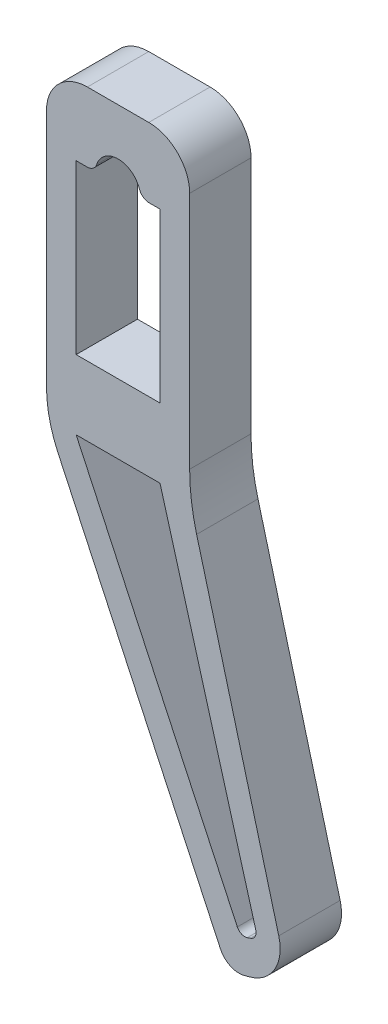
ISO-10303-21;
HEADER;
FILE_DESCRIPTION(('STEP AP214'),'2;1');
FILE_NAME('part.step','',(''),(''),'','','');
FILE_SCHEMA(('AUTOMOTIVE_DESIGN { 1 0 10303 214 1 1 1 1 }'));
ENDSEC;
DATA;
#1=APPLICATION_CONTEXT('core data for automotive mechanical design processes');
#2=APPLICATION_PROTOCOL_DEFINITION('international standard','automotive_design',2000,#1);
#3=PRODUCT_CONTEXT('',#1,'mechanical');
#4=PRODUCT('Part','Part','',(#3));
#5=PRODUCT_RELATED_PRODUCT_CATEGORY('part','',(#4));
#6=PRODUCT_DEFINITION_FORMATION('','',#4);
#7=PRODUCT_DEFINITION_CONTEXT('part definition',#1,'design');
#8=PRODUCT_DEFINITION('design','',#6,#7);
#9=PRODUCT_DEFINITION_SHAPE('','',#8);
#10=(LENGTH_UNIT() NAMED_UNIT(*) SI_UNIT(.MILLI.,.METRE.));
#11=(NAMED_UNIT(*) PLANE_ANGLE_UNIT() SI_UNIT($,.RADIAN.));
#12=(NAMED_UNIT(*) SI_UNIT($,.STERADIAN.) SOLID_ANGLE_UNIT());
#13=UNCERTAINTY_MEASURE_WITH_UNIT(LENGTH_MEASURE(1.E-05),#10,'distance_accuracy_value','');
#14=(GEOMETRIC_REPRESENTATION_CONTEXT(3) GLOBAL_UNCERTAINTY_ASSIGNED_CONTEXT((#13)) GLOBAL_UNIT_ASSIGNED_CONTEXT((#10,
#11,#12)) REPRESENTATION_CONTEXT('',''));
#15=CARTESIAN_POINT('',(0.,0.,0.));
#16=DIRECTION('',(0.,0.,1.));
#17=DIRECTION('',(1.,0.,0.));
#18=AXIS2_PLACEMENT_3D('',#15,#16,#17);
#19=CARTESIAN_POINT('',(-10.25,20.525,0.));
#20=DIRECTION('',(0.,1.,0.));
#21=DIRECTION('',(0.,0.,1.));
#22=AXIS2_PLACEMENT_3D('',#19,#20,#21);
#23=PLANE('',#22);
#24=DIRECTION('',(-1.,0.,0.));
#25=VECTOR('',#24,1.);
#26=CARTESIAN_POINT('',(-10.25,20.525,0.));
#27=LINE('',#26,#25);
#28=CARTESIAN_POINT('',(-7.59934207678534,20.525,0.));
#29=VERTEX_POINT('',#28);
#30=CARTESIAN_POINT('',(-10.25,20.525,0.));
#31=VERTEX_POINT('',#30);
#32=EDGE_CURVE('E257',#29,#31,#27,.T.);
#33=ORIENTED_EDGE('',*,*,#32,.F.);
#34=DIRECTION('',(0.,0.,1.));
#35=VECTOR('',#34,1.);
#36=CARTESIAN_POINT('',(-7.59934207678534,20.525,0.));
#37=LINE('',#36,#35);
#38=CARTESIAN_POINT('',(-7.59934207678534,20.525,15.));
#39=VERTEX_POINT('',#38);
#40=EDGE_CURVE('E390',#29,#39,#37,.T.);
#41=ORIENTED_EDGE('',*,*,#40,.T.);
#42=DIRECTION('',(-1.,0.,0.));
#43=VECTOR('',#42,1.);
#44=CARTESIAN_POINT('',(-10.25,20.525,15.));
#45=LINE('',#44,#43);
#46=CARTESIAN_POINT('',(-10.25,20.525,15.));
#47=VERTEX_POINT('',#46);
#48=EDGE_CURVE('E269',#39,#47,#45,.T.);
#49=ORIENTED_EDGE('',*,*,#48,.T.);
#50=DIRECTION('',(0.,0.,1.));
#51=VECTOR('',#50,1.);
#52=CARTESIAN_POINT('',(-10.25,20.525,0.));
#53=LINE('',#52,#51);
#54=EDGE_CURVE('E282',#31,#47,#53,.T.);
#55=ORIENTED_EDGE('',*,*,#54,.F.);
#56=EDGE_LOOP('',(#33,#41,#49,#55));
#57=FACE_BOUND('',#56,.T.);
#58=ADVANCED_FACE('F36',(#57),#23,.F.);
#59=CARTESIAN_POINT('',(17.5,-37.5,15.));
#60=DIRECTION('',(-1.,0.,0.));
#61=DIRECTION('',(0.,0.,1.));
#62=AXIS2_PLACEMENT_3D('',#59,#60,#61);
#63=PLANE('',#62);
#64=DIRECTION('',(0.,1.,0.));
#65=VECTOR('',#64,1.);
#66=CARTESIAN_POINT('',(17.5,-37.5,0.));
#67=LINE('',#66,#65);
#68=CARTESIAN_POINT('',(17.5,-30.9173751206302,0.));
#69=VERTEX_POINT('',#68);
#70=CARTESIAN_POINT('',(17.5,27.5,0.));
#71=VERTEX_POINT('',#70);
#72=EDGE_CURVE('E295',#69,#71,#67,.T.);
#73=ORIENTED_EDGE('',*,*,#72,.T.);
#74=DIRECTION('',(0.,0.,-1.));
#75=VECTOR('',#74,1.);
#76=CARTESIAN_POINT('',(17.5,27.5,15.));
#77=LINE('',#76,#75);
#78=CARTESIAN_POINT('',(17.5,27.5,15.));
#79=VERTEX_POINT('',#78);
#80=EDGE_CURVE('E388',#71,#79,#77,.F.);
#81=ORIENTED_EDGE('',*,*,#80,.T.);
#82=DIRECTION('',(0.,1.,0.));
#83=VECTOR('',#82,1.);
#84=CARTESIAN_POINT('',(17.5,-37.5,15.));
#85=LINE('',#84,#83);
#86=CARTESIAN_POINT('',(17.5,-30.9173751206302,15.));
#87=VERTEX_POINT('',#86);
#88=EDGE_CURVE('E301',#87,#79,#85,.T.);
#89=ORIENTED_EDGE('',*,*,#88,.F.);
#90=DIRECTION('',(0.,0.,-1.));
#91=VECTOR('',#90,1.);
#92=CARTESIAN_POINT('',(17.5,-30.9173751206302,15.));
#93=LINE('',#92,#91);
#94=EDGE_CURVE('E347',#87,#69,#93,.T.);
#95=ORIENTED_EDGE('',*,*,#94,.T.);
#96=EDGE_LOOP('',(#73,#81,#89,#95));
#97=FACE_BOUND('',#96,.T.);
#98=ADVANCED_FACE('F442',(#97),#63,.F.);
#99=CARTESIAN_POINT('',(-17.5,37.5,15.));
#100=DIRECTION('',(0.,-1.,0.));
#101=DIRECTION('',(0.,0.,-1.));
#102=AXIS2_PLACEMENT_3D('',#99,#100,#101);
#103=PLANE('',#102);
#104=DIRECTION('',(-1.,0.,0.));
#105=VECTOR('',#104,1.);
#106=CARTESIAN_POINT('',(-17.5,37.5,0.));
#107=LINE('',#106,#105);
#108=CARTESIAN_POINT('',(7.50000000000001,37.5,0.));
#109=VERTEX_POINT('',#108);
#110=CARTESIAN_POINT('',(-7.49999999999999,37.5,0.));
#111=VERTEX_POINT('',#110);
#112=EDGE_CURVE('E313',#109,#111,#107,.T.);
#113=ORIENTED_EDGE('',*,*,#112,.T.);
#114=DIRECTION('',(0.,0.,-1.));
#115=VECTOR('',#114,1.);
#116=CARTESIAN_POINT('',(-7.49999999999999,37.5,15.));
#117=LINE('',#116,#115);
#118=CARTESIAN_POINT('',(-7.49999999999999,37.5,15.));
#119=VERTEX_POINT('',#118);
#120=EDGE_CURVE('E382',#111,#119,#117,.F.);
#121=ORIENTED_EDGE('',*,*,#120,.T.);
#122=DIRECTION('',(-1.,0.,0.));
#123=VECTOR('',#122,1.);
#124=CARTESIAN_POINT('',(-17.5,37.5,15.));
#125=LINE('',#124,#123);
#126=CARTESIAN_POINT('',(7.50000000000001,37.5,15.));
#127=VERTEX_POINT('',#126);
#128=EDGE_CURVE('E304',#127,#119,#125,.T.);
#129=ORIENTED_EDGE('',*,*,#128,.F.);
#130=DIRECTION('',(0.,0.,-1.));
#131=VECTOR('',#130,1.);
#132=CARTESIAN_POINT('',(7.50000000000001,37.5,15.));
#133=LINE('',#132,#131);
#134=EDGE_CURVE('E379',#127,#109,#133,.T.);
#135=ORIENTED_EDGE('',*,*,#134,.T.);
#136=EDGE_LOOP('',(#113,#121,#129,#135));
#137=FACE_BOUND('',#136,.T.);
#138=ADVANCED_FACE('F446',(#137),#103,.F.);
#139=CARTESIAN_POINT('',(-17.5,-37.5,15.));
#140=DIRECTION('',(1.,0.,0.));
#141=DIRECTION('',(0.,0.,-1.));
#142=AXIS2_PLACEMENT_3D('',#139,#140,#141);
#143=PLANE('',#142);
#144=DIRECTION('',(0.,-1.,0.));
#145=VECTOR('',#144,1.);
#146=CARTESIAN_POINT('',(-17.5,-37.5,15.));
#147=LINE('',#146,#145);
#148=CARTESIAN_POINT('',(-17.5,27.5,15.));
#149=VERTEX_POINT('',#148);
#150=CARTESIAN_POINT('',(-17.5,-30.8491601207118,15.));
#151=VERTEX_POINT('',#150);
#152=EDGE_CURVE('E308',#149,#151,#147,.T.);
#153=ORIENTED_EDGE('',*,*,#152,.F.);
#154=DIRECTION('',(0.,0.,-1.));
#155=VECTOR('',#154,1.);
#156=CARTESIAN_POINT('',(-17.5,27.5,15.));
#157=LINE('',#156,#155);
#158=CARTESIAN_POINT('',(-17.5,27.5,0.));
#159=VERTEX_POINT('',#158);
#160=EDGE_CURVE('E372',#149,#159,#157,.T.);
#161=ORIENTED_EDGE('',*,*,#160,.T.);
#162=DIRECTION('',(0.,-1.,0.));
#163=VECTOR('',#162,1.);
#164=CARTESIAN_POINT('',(-17.5,-37.5,0.));
#165=LINE('',#164,#163);
#166=CARTESIAN_POINT('',(-17.5,-30.8491601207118,0.));
#167=VERTEX_POINT('',#166);
#168=EDGE_CURVE('E305',#159,#167,#165,.T.);
#169=ORIENTED_EDGE('',*,*,#168,.T.);
#170=DIRECTION('',(0.,0.,-1.));
#171=VECTOR('',#170,1.);
#172=CARTESIAN_POINT('',(-17.5,-30.8491601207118,15.));
#173=LINE('',#172,#171);
#174=EDGE_CURVE('E342',#167,#151,#173,.F.);
#175=ORIENTED_EDGE('',*,*,#174,.T.);
#176=EDGE_LOOP('',(#153,#161,#169,#175));
#177=FACE_BOUND('',#176,.T.);
#178=ADVANCED_FACE('F466',(#177),#143,.F.);
#179=CARTESIAN_POINT('',(0.,0.,15.));
#180=DIRECTION('',(0.,0.,-1.));
#181=DIRECTION('',(-1.,0.,0.));
#182=AXIS2_PLACEMENT_3D('',#179,#180,#181);
#183=PLANE('',#182);
#184=DIRECTION('',(-1.,0.,0.));
#185=VECTOR('',#184,1.);
#186=CARTESIAN_POINT('',(-10.25,-37.5,15.));
#187=LINE('',#186,#185);
#188=CARTESIAN_POINT('',(10.25,-37.5,15.));
#189=VERTEX_POINT('',#188);
#190=CARTESIAN_POINT('',(-10.25,-37.5,15.));
#191=VERTEX_POINT('',#190);
#192=EDGE_CURVE('E241',#189,#191,#187,.T.);
#193=ORIENTED_EDGE('',*,*,#192,.F.);
#194=DIRECTION('',(-0.271831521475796,0.962344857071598,0.));
#195=VECTOR('',#194,1.);
#196=CARTESIAN_POINT('',(10.25,-37.5,15.));
#197=LINE('',#196,#195);
#198=CARTESIAN_POINT('',(33.6509636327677,-120.344685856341,15.));
#199=VERTEX_POINT('',#198);
#200=EDGE_CURVE('E231',#199,#189,#197,.T.);
#201=ORIENTED_EDGE('',*,*,#200,.F.);
#202=CARTESIAN_POINT('',(31.7262739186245,-120.888348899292,15.));
#203=DIRECTION('',(0.,0.,-1.));
#204=DIRECTION('',(-1.,0.,0.));
#205=AXIS2_PLACEMENT_3D('',#202,#203,#204);
#206=CIRCLE('',#205,2.);
#207=CARTESIAN_POINT('',(32.3542260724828,-122.787210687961,15.));
#208=VERTEX_POINT('',#207);
#209=EDGE_CURVE('E369',#199,#208,#206,.T.);
#210=ORIENTED_EDGE('',*,*,#209,.T.);
#211=DIRECTION('',(0.949430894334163,0.313976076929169,0.));
#212=VECTOR('',#211,1.);
#213=CARTESIAN_POINT('',(34.17117388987,-122.186347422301,15.));
#214=LINE('',#213,#212);
#215=CARTESIAN_POINT('',(31.5875594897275,-123.040746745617,15.));
#216=VERTEX_POINT('',#215);
#217=EDGE_CURVE('E698',#216,#208,#214,.T.);
#218=ORIENTED_EDGE('',*,*,#217,.F.);
#219=CARTESIAN_POINT('',(30.9596073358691,-121.141884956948,15.));
#220=DIRECTION('',(0.,0.,-1.));
#221=DIRECTION('',(-1.,0.,0.));
#222=AXIS2_PLACEMENT_3D('',#219,#220,#221);
#223=CIRCLE('',#222,2.);
#224=CARTESIAN_POINT('',(29.1469917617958,-121.98712148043,15.));
#225=VERTEX_POINT('',#224);
#226=EDGE_CURVE('E365',#216,#225,#223,.T.);
#227=ORIENTED_EDGE('',*,*,#226,.T.);
#228=DIRECTION('',(0.422618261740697,-0.906307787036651,0.));
#229=VECTOR('',#228,1.);
#230=CARTESIAN_POINT('',(29.8987348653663,-123.599239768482,15.));
#231=LINE('',#230,#229);
#232=EDGE_CURVE('E224',#191,#225,#231,.T.);
#233=ORIENTED_EDGE('',*,*,#232,.F.);
#234=EDGE_LOOP('',(#193,#201,#210,#218,#227,#233));
#235=FACE_BOUND('',#234,.T.);
#236=ORIENTED_EDGE('',*,*,#48,.F.);
#237=CARTESIAN_POINT('',(-7.59934207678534,23.025,15.));
#238=DIRECTION('',(0.,0.,-1.));
#239=DIRECTION('',(-1.,0.,0.));
#240=AXIS2_PLACEMENT_3D('',#237,#238,#239);
#241=CIRCLE('',#240,2.5);
#242=CARTESIAN_POINT('',(-5.22454767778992,22.24375,15.));
#243=VERTEX_POINT('',#242);
#244=EDGE_CURVE('E395',#39,#243,#241,.F.);
#245=ORIENTED_EDGE('',*,*,#244,.T.);
#246=CARTESIAN_POINT('',(0.,20.525,15.));
#247=DIRECTION('',(0.,0.,1.));
#248=DIRECTION('',(1.,0.,0.));
#249=AXIS2_PLACEMENT_3D('',#246,#247,#248);
#250=CIRCLE('',#249,5.5);
#251=CARTESIAN_POINT('',(5.22454767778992,22.24375,15.));
#252=VERTEX_POINT('',#251);
#253=EDGE_CURVE('E248',#252,#243,#250,.T.);
#254=ORIENTED_EDGE('',*,*,#253,.F.);
#255=CARTESIAN_POINT('',(7.59934207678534,23.025,15.));
#256=DIRECTION('',(0.,0.,-1.));
#257=DIRECTION('',(-1.,0.,0.));
#258=AXIS2_PLACEMENT_3D('',#255,#256,#257);
#259=CIRCLE('',#258,2.5);
#260=CARTESIAN_POINT('',(7.59934207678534,20.525,15.));
#261=VERTEX_POINT('',#260);
#262=EDGE_CURVE('E393',#252,#261,#259,.F.);
#263=ORIENTED_EDGE('',*,*,#262,.T.);
#264=CARTESIAN_POINT('',(10.25,20.525,15.));
#265=VERTEX_POINT('',#264);
#266=EDGE_CURVE('E270',#265,#261,#45,.T.);
#267=ORIENTED_EDGE('',*,*,#266,.F.);
#268=DIRECTION('',(0.,1.,0.));
#269=VECTOR('',#268,1.);
#270=CARTESIAN_POINT('',(10.25,-20.525,15.));
#271=LINE('',#270,#269);
#272=CARTESIAN_POINT('',(10.25,-20.525,15.));
#273=VERTEX_POINT('',#272);
#274=EDGE_CURVE('E252',#273,#265,#271,.T.);
#275=ORIENTED_EDGE('',*,*,#274,.F.);
#276=DIRECTION('',(1.,0.,0.));
#277=VECTOR('',#276,1.);
#278=CARTESIAN_POINT('',(-10.25,-20.525,15.));
#279=LINE('',#278,#277);
#280=CARTESIAN_POINT('',(-10.25,-20.525,15.));
#281=VERTEX_POINT('',#280);
#282=EDGE_CURVE('E258',#281,#273,#279,.T.);
#283=ORIENTED_EDGE('',*,*,#282,.F.);
#284=DIRECTION('',(0.,-1.,0.));
#285=VECTOR('',#284,1.);
#286=CARTESIAN_POINT('',(-10.25,-20.525,15.));
#287=LINE('',#286,#285);
#288=EDGE_CURVE('E272',#47,#281,#287,.T.);
#289=ORIENTED_EDGE('',*,*,#288,.F.);
#290=EDGE_LOOP('',(#236,#245,#254,#263,#267,#275,#283,#289));
#291=FACE_BOUND('',#290,.T.);
#292=ORIENTED_EDGE('',*,*,#128,.T.);
#293=CARTESIAN_POINT('',(-7.49999999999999,27.5,15.));
#294=DIRECTION('',(0.,0.,-1.));
#295=DIRECTION('',(-1.,0.,0.));
#296=AXIS2_PLACEMENT_3D('',#293,#294,#295);
#297=CIRCLE('',#296,10.);
#298=EDGE_CURVE('E386',#119,#149,#297,.F.);
#299=ORIENTED_EDGE('',*,*,#298,.T.);
#300=ORIENTED_EDGE('',*,*,#152,.T.);
#301=CARTESIAN_POINT('',(12.5,-30.8491601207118,15.));
#302=DIRECTION('',(0.,0.,-1.));
#303=DIRECTION('',(-1.,0.,0.));
#304=AXIS2_PLACEMENT_3D('',#301,#302,#303);
#305=CIRCLE('',#304,30.);
#306=CARTESIAN_POINT('',(-14.6892336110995,-43.5277079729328,15.));
#307=VERTEX_POINT('',#306);
#308=EDGE_CURVE('E345',#151,#307,#305,.F.);
#309=ORIENTED_EDGE('',*,*,#308,.T.);
#310=DIRECTION('',(0.422618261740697,-0.906307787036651,0.));
#311=VECTOR('',#310,1.);
#312=CARTESIAN_POINT('',(-17.5,-37.5,15.));
#313=LINE('',#312,#311);
#314=CARTESIAN_POINT('',(25.0261333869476,-128.697587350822,15.));
#315=VERTEX_POINT('',#314);
#316=EDGE_CURVE('E279',#307,#315,#313,.T.);
#317=ORIENTED_EDGE('',*,*,#316,.T.);
#318=CARTESIAN_POINT('',(29.5576723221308,-126.584496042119,15.));
#319=DIRECTION('',(0.,0.,-1.));
#320=DIRECTION('',(-1.,0.,0.));
#321=AXIS2_PLACEMENT_3D('',#318,#319,#320);
#322=CIRCLE('',#321,5.);
#323=CARTESIAN_POINT('',(30.8517675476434,-131.414125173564,15.));
#324=VERTEX_POINT('',#323);
#325=EDGE_CURVE('E329',#315,#324,#322,.F.);
#326=ORIENTED_EDGE('',*,*,#325,.T.);
#327=DIRECTION('',(0.965925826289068,0.258819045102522,0.));
#328=VECTOR('',#327,1.);
#329=CARTESIAN_POINT('',(26.7992275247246,-132.5,15.));
#330=LINE('',#329,#328);
#331=CARTESIAN_POINT('',(32.2136718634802,-131.049204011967,15.));
#332=VERTEX_POINT('',#331);
#333=EDGE_CURVE('E297',#324,#332,#330,.T.);
#334=ORIENTED_EDGE('',*,*,#333,.T.);
#335=CARTESIAN_POINT('',(29.625481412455,-121.389945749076,15.));
#336=DIRECTION('',(0.,0.,-1.));
#337=DIRECTION('',(-1.,0.,0.));
#338=AXIS2_PLACEMENT_3D('',#335,#336,#337);
#339=CIRCLE('',#338,10.);
#340=CARTESIAN_POINT('',(39.2847396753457,-118.801755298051,15.));
#341=VERTEX_POINT('',#340);
#342=EDGE_CURVE('E319',#332,#341,#339,.F.);
#343=ORIENTED_EDGE('',*,*,#342,.T.);
#344=DIRECTION('',(-0.258819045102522,0.965925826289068,0.));
#345=VECTOR('',#344,1.);
#346=CARTESIAN_POINT('',(41.8729301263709,-128.461013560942,15.));
#347=LINE('',#346,#345);
#348=CARTESIAN_POINT('',(19.2037086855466,-43.8583273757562,15.));
#349=VERTEX_POINT('',#348);
#350=EDGE_CURVE('E290',#341,#349,#347,.T.);
#351=ORIENTED_EDGE('',*,*,#350,.T.);
#352=CARTESIAN_POINT('',(67.5,-30.9173751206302,15.));
#353=DIRECTION('',(0.,0.,-1.));
#354=DIRECTION('',(-1.,0.,0.));
#355=AXIS2_PLACEMENT_3D('',#352,#353,#354);
#356=CIRCLE('',#355,50.);
#357=EDGE_CURVE('E354',#349,#87,#356,.T.);
#358=ORIENTED_EDGE('',*,*,#357,.T.);
#359=ORIENTED_EDGE('',*,*,#88,.T.);
#360=CARTESIAN_POINT('',(7.50000000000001,27.5,15.));
#361=DIRECTION('',(0.,0.,-1.));
#362=DIRECTION('',(-1.,0.,0.));
#363=AXIS2_PLACEMENT_3D('',#360,#361,#362);
#364=CIRCLE('',#363,10.);
#365=EDGE_CURVE('E384',#79,#127,#364,.F.);
#366=ORIENTED_EDGE('',*,*,#365,.T.);
#367=EDGE_LOOP('',(#292,#299,#300,#309,#317,#326,#334,#343,#351,#358,#359,#366));
#368=FACE_BOUND('',#367,.T.);
#369=ADVANCED_FACE('F414',(#235,#291,#368),#183,.F.);
#370=CARTESIAN_POINT('',(0.,0.,0.));
#371=DIRECTION('',(0.,0.,-1.));
#372=DIRECTION('',(-1.,0.,0.));
#373=AXIS2_PLACEMENT_3D('',#370,#371,#372);
#374=PLANE('',#373);
#375=DIRECTION('',(0.949430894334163,0.313976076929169,0.));
#376=VECTOR('',#375,1.);
#377=CARTESIAN_POINT('',(34.17117388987,-122.186347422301,0.));
#378=LINE('',#377,#376);
#379=CARTESIAN_POINT('',(31.5875594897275,-123.040746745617,0.));
#380=VERTEX_POINT('',#379);
#381=CARTESIAN_POINT('',(32.3542260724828,-122.787210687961,0.));
#382=VERTEX_POINT('',#381);
#383=EDGE_CURVE('E225',#380,#382,#378,.T.);
#384=ORIENTED_EDGE('',*,*,#383,.T.);
#385=CARTESIAN_POINT('',(31.7262739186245,-120.888348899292,0.));
#386=DIRECTION('',(0.,0.,-1.));
#387=DIRECTION('',(-1.,0.,0.));
#388=AXIS2_PLACEMENT_3D('',#385,#386,#387);
#389=CIRCLE('',#388,2.);
#390=CARTESIAN_POINT('',(33.6509636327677,-120.344685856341,0.));
#391=VERTEX_POINT('',#390);
#392=EDGE_CURVE('E220',#382,#391,#389,.F.);
#393=ORIENTED_EDGE('',*,*,#392,.T.);
#394=DIRECTION('',(-0.271831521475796,0.962344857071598,0.));
#395=VECTOR('',#394,1.);
#396=CARTESIAN_POINT('',(10.25,-37.5,0.));
#397=LINE('',#396,#395);
#398=CARTESIAN_POINT('',(10.25,-37.5,0.));
#399=VERTEX_POINT('',#398);
#400=EDGE_CURVE('E211',#391,#399,#397,.T.);
#401=ORIENTED_EDGE('',*,*,#400,.T.);
#402=DIRECTION('',(-1.,0.,0.));
#403=VECTOR('',#402,1.);
#404=CARTESIAN_POINT('',(-10.25,-37.5,0.));
#405=LINE('',#404,#403);
#406=CARTESIAN_POINT('',(-10.25,-37.5,0.));
#407=VERTEX_POINT('',#406);
#408=EDGE_CURVE('E218',#399,#407,#405,.T.);
#409=ORIENTED_EDGE('',*,*,#408,.T.);
#410=DIRECTION('',(0.422618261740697,-0.906307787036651,0.));
#411=VECTOR('',#410,1.);
#412=CARTESIAN_POINT('',(29.8987348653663,-123.599239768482,0.));
#413=LINE('',#412,#411);
#414=CARTESIAN_POINT('',(29.1469917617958,-121.98712148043,0.));
#415=VERTEX_POINT('',#414);
#416=EDGE_CURVE('E239',#407,#415,#413,.T.);
#417=ORIENTED_EDGE('',*,*,#416,.T.);
#418=CARTESIAN_POINT('',(30.9596073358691,-121.141884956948,0.));
#419=DIRECTION('',(0.,0.,-1.));
#420=DIRECTION('',(-1.,0.,0.));
#421=AXIS2_PLACEMENT_3D('',#418,#419,#420);
#422=CIRCLE('',#421,2.);
#423=EDGE_CURVE('E367',#415,#380,#422,.F.);
#424=ORIENTED_EDGE('',*,*,#423,.T.);
#425=EDGE_LOOP('',(#384,#393,#401,#409,#417,#424));
#426=FACE_BOUND('',#425,.T.);
#427=CARTESIAN_POINT('',(0.,20.525,0.));
#428=DIRECTION('',(0.,0.,1.));
#429=DIRECTION('',(1.,0.,0.));
#430=AXIS2_PLACEMENT_3D('',#427,#428,#429);
#431=CIRCLE('',#430,5.5);
#432=CARTESIAN_POINT('',(5.22454767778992,22.24375,0.));
#433=VERTEX_POINT('',#432);
#434=CARTESIAN_POINT('',(-5.22454767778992,22.24375,0.));
#435=VERTEX_POINT('',#434);
#436=EDGE_CURVE('E250',#433,#435,#431,.T.);
#437=ORIENTED_EDGE('',*,*,#436,.T.);
#438=CARTESIAN_POINT('',(-7.59934207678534,23.025,0.));
#439=DIRECTION('',(0.,0.,-1.));
#440=DIRECTION('',(-1.,0.,0.));
#441=AXIS2_PLACEMENT_3D('',#438,#439,#440);
#442=CIRCLE('',#441,2.5);
#443=EDGE_CURVE('E44',#435,#29,#442,.T.);
#444=ORIENTED_EDGE('',*,*,#443,.T.);
#445=ORIENTED_EDGE('',*,*,#32,.T.);
#446=DIRECTION('',(0.,-1.,0.));
#447=VECTOR('',#446,1.);
#448=CARTESIAN_POINT('',(-10.25,-20.525,0.));
#449=LINE('',#448,#447);
#450=CARTESIAN_POINT('',(-10.25,-20.525,0.));
#451=VERTEX_POINT('',#450);
#452=EDGE_CURVE('E261',#31,#451,#449,.T.);
#453=ORIENTED_EDGE('',*,*,#452,.T.);
#454=DIRECTION('',(1.,0.,0.));
#455=VECTOR('',#454,1.);
#456=CARTESIAN_POINT('',(-10.25,-20.525,0.));
#457=LINE('',#456,#455);
#458=CARTESIAN_POINT('',(10.25,-20.525,0.));
#459=VERTEX_POINT('',#458);
#460=EDGE_CURVE('E264',#451,#459,#457,.T.);
#461=ORIENTED_EDGE('',*,*,#460,.T.);
#462=DIRECTION('',(0.,1.,0.));
#463=VECTOR('',#462,1.);
#464=CARTESIAN_POINT('',(10.25,-20.525,0.));
#465=LINE('',#464,#463);
#466=CARTESIAN_POINT('',(10.25,20.525,0.));
#467=VERTEX_POINT('',#466);
#468=EDGE_CURVE('E254',#459,#467,#465,.T.);
#469=ORIENTED_EDGE('',*,*,#468,.T.);
#470=CARTESIAN_POINT('',(7.59934207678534,20.525,0.));
#471=VERTEX_POINT('',#470);
#472=EDGE_CURVE('E259',#467,#471,#27,.T.);
#473=ORIENTED_EDGE('',*,*,#472,.T.);
#474=CARTESIAN_POINT('',(7.59934207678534,23.025,0.));
#475=DIRECTION('',(0.,0.,-1.));
#476=DIRECTION('',(-1.,0.,0.));
#477=AXIS2_PLACEMENT_3D('',#474,#475,#476);
#478=CIRCLE('',#477,2.5);
#479=EDGE_CURVE('E401',#471,#433,#478,.T.);
#480=ORIENTED_EDGE('',*,*,#479,.T.);
#481=EDGE_LOOP('',(#437,#444,#445,#453,#461,#469,#473,#480));
#482=FACE_BOUND('',#481,.T.);
#483=ORIENTED_EDGE('',*,*,#168,.F.);
#484=CARTESIAN_POINT('',(-7.49999999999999,27.5,0.));
#485=DIRECTION('',(0.,0.,-1.));
#486=DIRECTION('',(-1.,0.,0.));
#487=AXIS2_PLACEMENT_3D('',#484,#485,#486);
#488=CIRCLE('',#487,10.);
#489=EDGE_CURVE('E377',#159,#111,#488,.T.);
#490=ORIENTED_EDGE('',*,*,#489,.T.);
#491=ORIENTED_EDGE('',*,*,#112,.F.);
#492=CARTESIAN_POINT('',(7.50000000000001,27.5,0.));
#493=DIRECTION('',(0.,0.,-1.));
#494=DIRECTION('',(-1.,0.,0.));
#495=AXIS2_PLACEMENT_3D('',#492,#493,#494);
#496=CIRCLE('',#495,10.);
#497=EDGE_CURVE('E375',#109,#71,#496,.T.);
#498=ORIENTED_EDGE('',*,*,#497,.T.);
#499=ORIENTED_EDGE('',*,*,#72,.F.);
#500=CARTESIAN_POINT('',(67.5,-30.9173751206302,0.));
#501=DIRECTION('',(0.,0.,-1.));
#502=DIRECTION('',(-1.,0.,0.));
#503=AXIS2_PLACEMENT_3D('',#500,#501,#502);
#504=CIRCLE('',#503,50.);
#505=CARTESIAN_POINT('',(19.2037086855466,-43.8583273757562,0.));
#506=VERTEX_POINT('',#505);
#507=EDGE_CURVE('E352',#69,#506,#504,.F.);
#508=ORIENTED_EDGE('',*,*,#507,.T.);
#509=DIRECTION('',(-0.258819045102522,0.965925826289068,0.));
#510=VECTOR('',#509,1.);
#511=CARTESIAN_POINT('',(41.8729301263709,-128.461013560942,0.));
#512=LINE('',#511,#510);
#513=CARTESIAN_POINT('',(39.2847396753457,-118.801755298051,0.));
#514=VERTEX_POINT('',#513);
#515=EDGE_CURVE('E292',#514,#506,#512,.T.);
#516=ORIENTED_EDGE('',*,*,#515,.F.);
#517=CARTESIAN_POINT('',(29.625481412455,-121.389945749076,0.));
#518=DIRECTION('',(0.,0.,-1.));
#519=DIRECTION('',(-1.,0.,0.));
#520=AXIS2_PLACEMENT_3D('',#517,#518,#519);
#521=CIRCLE('',#520,10.);
#522=CARTESIAN_POINT('',(32.2136718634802,-131.049204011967,0.));
#523=VERTEX_POINT('',#522);
#524=EDGE_CURVE('E323',#514,#523,#521,.T.);
#525=ORIENTED_EDGE('',*,*,#524,.T.);
#526=DIRECTION('',(0.965925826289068,0.258819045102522,0.));
#527=VECTOR('',#526,1.);
#528=CARTESIAN_POINT('',(26.7992275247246,-132.5,0.));
#529=LINE('',#528,#527);
#530=CARTESIAN_POINT('',(30.8517675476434,-131.414125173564,0.));
#531=VERTEX_POINT('',#530);
#532=EDGE_CURVE('E289',#531,#523,#529,.T.);
#533=ORIENTED_EDGE('',*,*,#532,.F.);
#534=CARTESIAN_POINT('',(29.5576723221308,-126.584496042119,0.));
#535=DIRECTION('',(0.,0.,-1.));
#536=DIRECTION('',(-1.,0.,0.));
#537=AXIS2_PLACEMENT_3D('',#534,#535,#536);
#538=CIRCLE('',#537,5.);
#539=CARTESIAN_POINT('',(25.0261333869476,-128.697587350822,0.));
#540=VERTEX_POINT('',#539);
#541=EDGE_CURVE('E333',#531,#540,#538,.T.);
#542=ORIENTED_EDGE('',*,*,#541,.T.);
#543=DIRECTION('',(0.422618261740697,-0.906307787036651,0.));
#544=VECTOR('',#543,1.);
#545=CARTESIAN_POINT('',(-17.5,-37.5,0.));
#546=LINE('',#545,#544);
#547=CARTESIAN_POINT('',(-14.6892336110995,-43.5277079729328,0.));
#548=VERTEX_POINT('',#547);
#549=EDGE_CURVE('E287',#548,#540,#546,.T.);
#550=ORIENTED_EDGE('',*,*,#549,.F.);
#551=CARTESIAN_POINT('',(12.5,-30.8491601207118,0.));
#552=DIRECTION('',(0.,0.,-1.));
#553=DIRECTION('',(-1.,0.,0.));
#554=AXIS2_PLACEMENT_3D('',#551,#552,#553);
#555=CIRCLE('',#554,30.);
#556=EDGE_CURVE('E339',#548,#167,#555,.T.);
#557=ORIENTED_EDGE('',*,*,#556,.T.);
#558=EDGE_LOOP('',(#483,#490,#491,#498,#499,#508,#516,#525,#533,#542,#550,#557));
#559=FACE_BOUND('',#558,.T.);
#560=ADVANCED_FACE('F214',(#426,#482,#559),#374,.T.);
#561=CARTESIAN_POINT('',(41.8729301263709,-128.461013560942,0.));
#562=DIRECTION('',(0.965925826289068,0.258819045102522,0.));
#563=DIRECTION('',(-0.258819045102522,0.965925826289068,0.));
#564=AXIS2_PLACEMENT_3D('',#561,#562,#563);
#565=PLANE('',#564);
#566=ORIENTED_EDGE('',*,*,#515,.T.);
#567=DIRECTION('',(0.,0.,-1.));
#568=VECTOR('',#567,1.);
#569=CARTESIAN_POINT('',(19.2037086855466,-43.8583273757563,0.));
#570=LINE('',#569,#568);
#571=EDGE_CURVE('E350',#506,#349,#570,.F.);
#572=ORIENTED_EDGE('',*,*,#571,.T.);
#573=ORIENTED_EDGE('',*,*,#350,.F.);
#574=DIRECTION('',(0.,0.,1.));
#575=VECTOR('',#574,1.);
#576=CARTESIAN_POINT('',(39.2847396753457,-118.801755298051,0.));
#577=LINE('',#576,#575);
#578=EDGE_CURVE('E321',#341,#514,#577,.F.);
#579=ORIENTED_EDGE('',*,*,#578,.T.);
#580=EDGE_LOOP('',(#566,#572,#573,#579));
#581=FACE_BOUND('',#580,.T.);
#582=ADVANCED_FACE('F453',(#581),#565,.T.);
#583=CARTESIAN_POINT('',(26.7992275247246,-132.5,0.));
#584=DIRECTION('',(0.258819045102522,-0.965925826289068,0.));
#585=DIRECTION('',(0.965925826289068,0.258819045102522,0.));
#586=AXIS2_PLACEMENT_3D('',#583,#584,#585);
#587=PLANE('',#586);
#588=ORIENTED_EDGE('',*,*,#333,.F.);
#589=DIRECTION('',(0.,0.,1.));
#590=VECTOR('',#589,1.);
#591=CARTESIAN_POINT('',(30.8517675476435,-131.414125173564,0.));
#592=LINE('',#591,#590);
#593=EDGE_CURVE('E331',#324,#531,#592,.F.);
#594=ORIENTED_EDGE('',*,*,#593,.T.);
#595=ORIENTED_EDGE('',*,*,#532,.T.);
#596=DIRECTION('',(0.,0.,1.));
#597=VECTOR('',#596,1.);
#598=CARTESIAN_POINT('',(32.2136718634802,-131.049204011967,0.));
#599=LINE('',#598,#597);
#600=EDGE_CURVE('E310',#523,#332,#599,.T.);
#601=ORIENTED_EDGE('',*,*,#600,.T.);
#602=EDGE_LOOP('',(#588,#594,#595,#601));
#603=FACE_BOUND('',#602,.T.);
#604=ADVANCED_FACE('F456',(#603),#587,.T.);
#605=CARTESIAN_POINT('',(-17.5,-37.5,0.));
#606=DIRECTION('',(-0.906307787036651,-0.422618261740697,0.));
#607=DIRECTION('',(0.422618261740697,-0.906307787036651,0.));
#608=AXIS2_PLACEMENT_3D('',#605,#606,#607);
#609=PLANE('',#608);
#610=ORIENTED_EDGE('',*,*,#316,.F.);
#611=DIRECTION('',(0.,0.,-1.));
#612=VECTOR('',#611,1.);
#613=CARTESIAN_POINT('',(-14.6892336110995,-43.5277079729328,0.));
#614=LINE('',#613,#612);
#615=EDGE_CURVE('E336',#307,#548,#614,.T.);
#616=ORIENTED_EDGE('',*,*,#615,.T.);
#617=ORIENTED_EDGE('',*,*,#549,.T.);
#618=DIRECTION('',(0.,0.,1.));
#619=VECTOR('',#618,1.);
#620=CARTESIAN_POINT('',(25.0261333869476,-128.697587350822,0.));
#621=LINE('',#620,#619);
#622=EDGE_CURVE('E326',#540,#315,#621,.T.);
#623=ORIENTED_EDGE('',*,*,#622,.T.);
#624=EDGE_LOOP('',(#610,#616,#617,#623));
#625=FACE_BOUND('',#624,.T.);
#626=ADVANCED_FACE('F452',(#625),#609,.T.);
#627=CARTESIAN_POINT('',(10.25,-20.525,0.));
#628=DIRECTION('',(1.,0.,0.));
#629=DIRECTION('',(0.,0.,-1.));
#630=AXIS2_PLACEMENT_3D('',#627,#628,#629);
#631=PLANE('',#630);
#632=ORIENTED_EDGE('',*,*,#274,.T.);
#633=DIRECTION('',(0.,0.,1.));
#634=VECTOR('',#633,1.);
#635=CARTESIAN_POINT('',(10.25,20.525,0.));
#636=LINE('',#635,#634);
#637=EDGE_CURVE('E267',#467,#265,#636,.T.);
#638=ORIENTED_EDGE('',*,*,#637,.F.);
#639=ORIENTED_EDGE('',*,*,#468,.F.);
#640=DIRECTION('',(0.,0.,1.));
#641=VECTOR('',#640,1.);
#642=CARTESIAN_POINT('',(10.25,-20.525,0.));
#643=LINE('',#642,#641);
#644=EDGE_CURVE('E277',#459,#273,#643,.T.);
#645=ORIENTED_EDGE('',*,*,#644,.T.);
#646=EDGE_LOOP('',(#632,#638,#639,#645));
#647=FACE_BOUND('',#646,.T.);
#648=ADVANCED_FACE('F426',(#647),#631,.F.);
#649=CARTESIAN_POINT('',(-10.25,-20.525,0.));
#650=DIRECTION('',(0.,-1.,0.));
#651=DIRECTION('',(0.,0.,-1.));
#652=AXIS2_PLACEMENT_3D('',#649,#650,#651);
#653=PLANE('',#652);
#654=ORIENTED_EDGE('',*,*,#282,.T.);
#655=ORIENTED_EDGE('',*,*,#644,.F.);
#656=ORIENTED_EDGE('',*,*,#460,.F.);
#657=DIRECTION('',(0.,0.,1.));
#658=VECTOR('',#657,1.);
#659=CARTESIAN_POINT('',(-10.25,-20.525,0.));
#660=LINE('',#659,#658);
#661=EDGE_CURVE('E280',#451,#281,#660,.T.);
#662=ORIENTED_EDGE('',*,*,#661,.T.);
#663=EDGE_LOOP('',(#654,#655,#656,#662));
#664=FACE_BOUND('',#663,.T.);
#665=ADVANCED_FACE('F429',(#664),#653,.F.);
#666=CARTESIAN_POINT('',(-10.25,-20.525,0.));
#667=DIRECTION('',(-1.,0.,0.));
#668=DIRECTION('',(0.,0.,1.));
#669=AXIS2_PLACEMENT_3D('',#666,#667,#668);
#670=PLANE('',#669);
#671=ORIENTED_EDGE('',*,*,#288,.T.);
#672=ORIENTED_EDGE('',*,*,#661,.F.);
#673=ORIENTED_EDGE('',*,*,#452,.F.);
#674=ORIENTED_EDGE('',*,*,#54,.T.);
#675=EDGE_LOOP('',(#671,#672,#673,#674));
#676=FACE_BOUND('',#675,.T.);
#677=ADVANCED_FACE('F432',(#676),#670,.F.);
#678=ORIENTED_EDGE('',*,*,#266,.T.);
#679=DIRECTION('',(0.,0.,1.));
#680=VECTOR('',#679,1.);
#681=CARTESIAN_POINT('',(7.59934207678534,20.525,0.));
#682=LINE('',#681,#680);
#683=EDGE_CURVE('E11',#261,#471,#682,.F.);
#684=ORIENTED_EDGE('',*,*,#683,.T.);
#685=ORIENTED_EDGE('',*,*,#472,.F.);
#686=ORIENTED_EDGE('',*,*,#637,.T.);
#687=EDGE_LOOP('',(#678,#684,#685,#686));
#688=FACE_BOUND('',#687,.T.);
#689=ADVANCED_FACE('F423',(#688),#23,.F.);
#690=CARTESIAN_POINT('',(0.,20.525,0.));
#691=DIRECTION('',(0.,0.,1.));
#692=DIRECTION('',(1.,0.,0.));
#693=AXIS2_PLACEMENT_3D('',#690,#691,#692);
#694=CYLINDRICAL_SURFACE('',#693,5.5);
#695=ORIENTED_EDGE('',*,*,#253,.T.);
#696=DIRECTION('',(0.,0.,1.));
#697=VECTOR('',#696,1.);
#698=CARTESIAN_POINT('',(-5.22454767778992,22.24375,0.));
#699=LINE('',#698,#697);
#700=EDGE_CURVE('E57',#243,#435,#699,.F.);
#701=ORIENTED_EDGE('',*,*,#700,.T.);
#702=ORIENTED_EDGE('',*,*,#436,.F.);
#703=DIRECTION('',(0.,0.,1.));
#704=VECTOR('',#703,1.);
#705=CARTESIAN_POINT('',(5.22454767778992,22.24375,0.));
#706=LINE('',#705,#704);
#707=EDGE_CURVE('E397',#433,#252,#706,.T.);
#708=ORIENTED_EDGE('',*,*,#707,.T.);
#709=EDGE_LOOP('',(#695,#701,#702,#708));
#710=FACE_BOUND('',#709,.T.);
#711=ADVANCED_FACE('F417',(#710),#694,.F.);
#712=CARTESIAN_POINT('',(29.8987348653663,-123.599239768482,0.));
#713=DIRECTION('',(-0.906307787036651,-0.422618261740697,0.));
#714=DIRECTION('',(0.422618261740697,-0.906307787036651,0.));
#715=AXIS2_PLACEMENT_3D('',#712,#713,#714);
#716=PLANE('',#715);
#717=ORIENTED_EDGE('',*,*,#232,.T.);
#718=DIRECTION('',(0.,0.,1.));
#719=VECTOR('',#718,1.);
#720=CARTESIAN_POINT('',(29.1469917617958,-121.98712148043,0.));
#721=LINE('',#720,#719);
#722=EDGE_CURVE('E361',#225,#415,#721,.F.);
#723=ORIENTED_EDGE('',*,*,#722,.T.);
#724=ORIENTED_EDGE('',*,*,#416,.F.);
#725=DIRECTION('',(0.,0.,1.));
#726=VECTOR('',#725,1.);
#727=CARTESIAN_POINT('',(-10.25,-37.5,0.));
#728=LINE('',#727,#726);
#729=EDGE_CURVE('E235',#407,#191,#728,.T.);
#730=ORIENTED_EDGE('',*,*,#729,.T.);
#731=EDGE_LOOP('',(#717,#723,#724,#730));
#732=FACE_BOUND('',#731,.T.);
#733=ADVANCED_FACE('F528',(#732),#716,.F.);
#734=CARTESIAN_POINT('',(-10.25,-37.5,0.));
#735=DIRECTION('',(0.,1.,0.));
#736=DIRECTION('',(0.,0.,1.));
#737=AXIS2_PLACEMENT_3D('',#734,#735,#736);
#738=PLANE('',#737);
#739=ORIENTED_EDGE('',*,*,#192,.T.);
#740=ORIENTED_EDGE('',*,*,#729,.F.);
#741=ORIENTED_EDGE('',*,*,#408,.F.);
#742=DIRECTION('',(0.,0.,1.));
#743=VECTOR('',#742,1.);
#744=CARTESIAN_POINT('',(10.25,-37.5,0.));
#745=LINE('',#744,#743);
#746=EDGE_CURVE('E228',#399,#189,#745,.T.);
#747=ORIENTED_EDGE('',*,*,#746,.T.);
#748=EDGE_LOOP('',(#739,#740,#741,#747));
#749=FACE_BOUND('',#748,.T.);
#750=ADVANCED_FACE('F237',(#749),#738,.F.);
#751=CARTESIAN_POINT('',(10.25,-37.5,0.));
#752=DIRECTION('',(0.962344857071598,0.271831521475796,0.));
#753=DIRECTION('',(-0.271831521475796,0.962344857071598,0.));
#754=AXIS2_PLACEMENT_3D('',#751,#752,#753);
#755=PLANE('',#754);
#756=ORIENTED_EDGE('',*,*,#400,.F.);
#757=DIRECTION('',(0.,0.,1.));
#758=VECTOR('',#757,1.);
#759=CARTESIAN_POINT('',(33.6509636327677,-120.344685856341,15.));
#760=LINE('',#759,#758);
#761=EDGE_CURVE('E363',#391,#199,#760,.T.);
#762=ORIENTED_EDGE('',*,*,#761,.T.);
#763=ORIENTED_EDGE('',*,*,#200,.T.);
#764=ORIENTED_EDGE('',*,*,#746,.F.);
#765=EDGE_LOOP('',(#756,#762,#763,#764));
#766=FACE_BOUND('',#765,.T.);
#767=ADVANCED_FACE('F229',(#766),#755,.F.);
#768=CARTESIAN_POINT('',(34.17117388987,-122.186347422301,0.));
#769=DIRECTION('',(0.313976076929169,-0.949430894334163,0.));
#770=DIRECTION('',(0.949430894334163,0.313976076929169,0.));
#771=AXIS2_PLACEMENT_3D('',#768,#769,#770);
#772=PLANE('',#771);
#773=ORIENTED_EDGE('',*,*,#383,.F.);
#774=DIRECTION('',(0.,0.,1.));
#775=VECTOR('',#774,1.);
#776=CARTESIAN_POINT('',(31.5875594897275,-123.040746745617,15.));
#777=LINE('',#776,#775);
#778=EDGE_CURVE('E358',#380,#216,#777,.T.);
#779=ORIENTED_EDGE('',*,*,#778,.T.);
#780=ORIENTED_EDGE('',*,*,#217,.T.);
#781=DIRECTION('',(0.,0.,1.));
#782=VECTOR('',#781,1.);
#783=CARTESIAN_POINT('',(32.3542260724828,-122.787210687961,0.));
#784=LINE('',#783,#782);
#785=EDGE_CURVE('E356',#208,#382,#784,.F.);
#786=ORIENTED_EDGE('',*,*,#785,.T.);
#787=EDGE_LOOP('',(#773,#779,#780,#786));
#788=FACE_BOUND('',#787,.T.);
#789=ADVANCED_FACE('F480',(#788),#772,.F.);
#790=CARTESIAN_POINT('',(29.625481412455,-121.389945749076,0.));
#791=DIRECTION('',(0.,0.,1.));
#792=DIRECTION('',(1.,0.,0.));
#793=AXIS2_PLACEMENT_3D('',#790,#791,#792);
#794=CYLINDRICAL_SURFACE('',#793,10.);
#795=ORIENTED_EDGE('',*,*,#524,.F.);
#796=ORIENTED_EDGE('',*,*,#578,.F.);
#797=ORIENTED_EDGE('',*,*,#342,.F.);
#798=ORIENTED_EDGE('',*,*,#600,.F.);
#799=EDGE_LOOP('',(#795,#796,#797,#798));
#800=FACE_BOUND('',#799,.T.);
#801=ADVANCED_FACE('F476',(#800),#794,.T.);
#802=CARTESIAN_POINT('',(29.5576723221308,-126.584496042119,0.));
#803=DIRECTION('',(0.,0.,1.));
#804=DIRECTION('',(1.,0.,0.));
#805=AXIS2_PLACEMENT_3D('',#802,#803,#804);
#806=CYLINDRICAL_SURFACE('',#805,5.);
#807=ORIENTED_EDGE('',*,*,#541,.F.);
#808=ORIENTED_EDGE('',*,*,#593,.F.);
#809=ORIENTED_EDGE('',*,*,#325,.F.);
#810=ORIENTED_EDGE('',*,*,#622,.F.);
#811=EDGE_LOOP('',(#807,#808,#809,#810));
#812=FACE_BOUND('',#811,.T.);
#813=ADVANCED_FACE('F479',(#812),#806,.T.);
#814=CARTESIAN_POINT('',(12.5,-30.8491601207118,0.));
#815=DIRECTION('',(0.,0.,1.));
#816=DIRECTION('',(1.,0.,0.));
#817=AXIS2_PLACEMENT_3D('',#814,#815,#816);
#818=CYLINDRICAL_SURFACE('',#817,30.);
#819=ORIENTED_EDGE('',*,*,#308,.F.);
#820=ORIENTED_EDGE('',*,*,#174,.F.);
#821=ORIENTED_EDGE('',*,*,#556,.F.);
#822=ORIENTED_EDGE('',*,*,#615,.F.);
#823=EDGE_LOOP('',(#819,#820,#821,#822));
#824=FACE_BOUND('',#823,.T.);
#825=ADVANCED_FACE('F484',(#824),#818,.T.);
#826=CARTESIAN_POINT('',(67.5,-30.9173751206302,15.));
#827=DIRECTION('',(0.,0.,-1.));
#828=DIRECTION('',(-1.,0.,0.));
#829=AXIS2_PLACEMENT_3D('',#826,#827,#828);
#830=CYLINDRICAL_SURFACE('',#829,50.);
#831=ORIENTED_EDGE('',*,*,#357,.F.);
#832=ORIENTED_EDGE('',*,*,#571,.F.);
#833=ORIENTED_EDGE('',*,*,#507,.F.);
#834=ORIENTED_EDGE('',*,*,#94,.F.);
#835=EDGE_LOOP('',(#831,#832,#833,#834));
#836=FACE_BOUND('',#835,.T.);
#837=ADVANCED_FACE('F488',(#836),#830,.F.);
#838=CARTESIAN_POINT('',(30.9596073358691,-121.141884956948,0.));
#839=DIRECTION('',(0.,0.,-1.));
#840=DIRECTION('',(-1.,0.,0.));
#841=AXIS2_PLACEMENT_3D('',#838,#839,#840);
#842=CYLINDRICAL_SURFACE('',#841,2.);
#843=ORIENTED_EDGE('',*,*,#423,.F.);
#844=ORIENTED_EDGE('',*,*,#722,.F.);
#845=ORIENTED_EDGE('',*,*,#226,.F.);
#846=ORIENTED_EDGE('',*,*,#778,.F.);
#847=EDGE_LOOP('',(#843,#844,#845,#846));
#848=FACE_BOUND('',#847,.T.);
#849=ADVANCED_FACE('F492',(#848),#842,.F.);
#850=CARTESIAN_POINT('',(31.7262739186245,-120.888348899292,0.));
#851=DIRECTION('',(0.,0.,-1.));
#852=DIRECTION('',(-1.,0.,0.));
#853=AXIS2_PLACEMENT_3D('',#850,#851,#852);
#854=CYLINDRICAL_SURFACE('',#853,2.);
#855=ORIENTED_EDGE('',*,*,#392,.F.);
#856=ORIENTED_EDGE('',*,*,#785,.F.);
#857=ORIENTED_EDGE('',*,*,#209,.F.);
#858=ORIENTED_EDGE('',*,*,#761,.F.);
#859=EDGE_LOOP('',(#855,#856,#857,#858));
#860=FACE_BOUND('',#859,.T.);
#861=ADVANCED_FACE('F496',(#860),#854,.F.);
#862=CARTESIAN_POINT('',(-7.49999999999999,27.5,15.));
#863=DIRECTION('',(0.,0.,-1.));
#864=DIRECTION('',(-1.,0.,0.));
#865=AXIS2_PLACEMENT_3D('',#862,#863,#864);
#866=CYLINDRICAL_SURFACE('',#865,10.);
#867=ORIENTED_EDGE('',*,*,#298,.F.);
#868=ORIENTED_EDGE('',*,*,#120,.F.);
#869=ORIENTED_EDGE('',*,*,#489,.F.);
#870=ORIENTED_EDGE('',*,*,#160,.F.);
#871=EDGE_LOOP('',(#867,#868,#869,#870));
#872=FACE_BOUND('',#871,.T.);
#873=ADVANCED_FACE('F500',(#872),#866,.T.);
#874=CARTESIAN_POINT('',(7.50000000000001,27.5,15.));
#875=DIRECTION('',(0.,0.,-1.));
#876=DIRECTION('',(-1.,0.,0.));
#877=AXIS2_PLACEMENT_3D('',#874,#875,#876);
#878=CYLINDRICAL_SURFACE('',#877,10.);
#879=ORIENTED_EDGE('',*,*,#365,.F.);
#880=ORIENTED_EDGE('',*,*,#80,.F.);
#881=ORIENTED_EDGE('',*,*,#497,.F.);
#882=ORIENTED_EDGE('',*,*,#134,.F.);
#883=EDGE_LOOP('',(#879,#880,#881,#882));
#884=FACE_BOUND('',#883,.T.);
#885=ADVANCED_FACE('F504',(#884),#878,.T.);
#886=CARTESIAN_POINT('',(-7.59934207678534,23.025,0.));
#887=DIRECTION('',(0.,0.,1.));
#888=DIRECTION('',(1.,0.,0.));
#889=AXIS2_PLACEMENT_3D('',#886,#887,#888);
#890=CYLINDRICAL_SURFACE('',#889,2.5);
#891=ORIENTED_EDGE('',*,*,#443,.F.);
#892=ORIENTED_EDGE('',*,*,#700,.F.);
#893=ORIENTED_EDGE('',*,*,#244,.F.);
#894=ORIENTED_EDGE('',*,*,#40,.F.);
#895=EDGE_LOOP('',(#891,#892,#893,#894));
#896=FACE_BOUND('',#895,.T.);
#897=ADVANCED_FACE('F411',(#896),#890,.T.);
#898=CARTESIAN_POINT('',(7.59934207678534,23.025,0.));
#899=DIRECTION('',(0.,0.,1.));
#900=DIRECTION('',(1.,0.,0.));
#901=AXIS2_PLACEMENT_3D('',#898,#899,#900);
#902=CYLINDRICAL_SURFACE('',#901,2.5);
#903=ORIENTED_EDGE('',*,*,#479,.F.);
#904=ORIENTED_EDGE('',*,*,#683,.F.);
#905=ORIENTED_EDGE('',*,*,#262,.F.);
#906=ORIENTED_EDGE('',*,*,#707,.F.);
#907=EDGE_LOOP('',(#903,#904,#905,#906));
#908=FACE_BOUND('',#907,.T.);
#909=ADVANCED_FACE('F38',(#908),#902,.T.);
#910=CLOSED_SHELL('',(#58,#98,#138,#178,#369,#560,#582,#604,#626,#648,#665,#677,#689,#711,#733,
#750,#767,#789,#801,#813,#825,#837,#849,#861,#873,#885,#897,#909));
#911=MANIFOLD_SOLID_BREP('B2',#910);
#912=ADVANCED_BREP_SHAPE_REPRESENTATION('',(#18,#911),#14);
#913=SHAPE_DEFINITION_REPRESENTATION(#9,#912);
ENDSEC;
END-ISO-10303-21;
